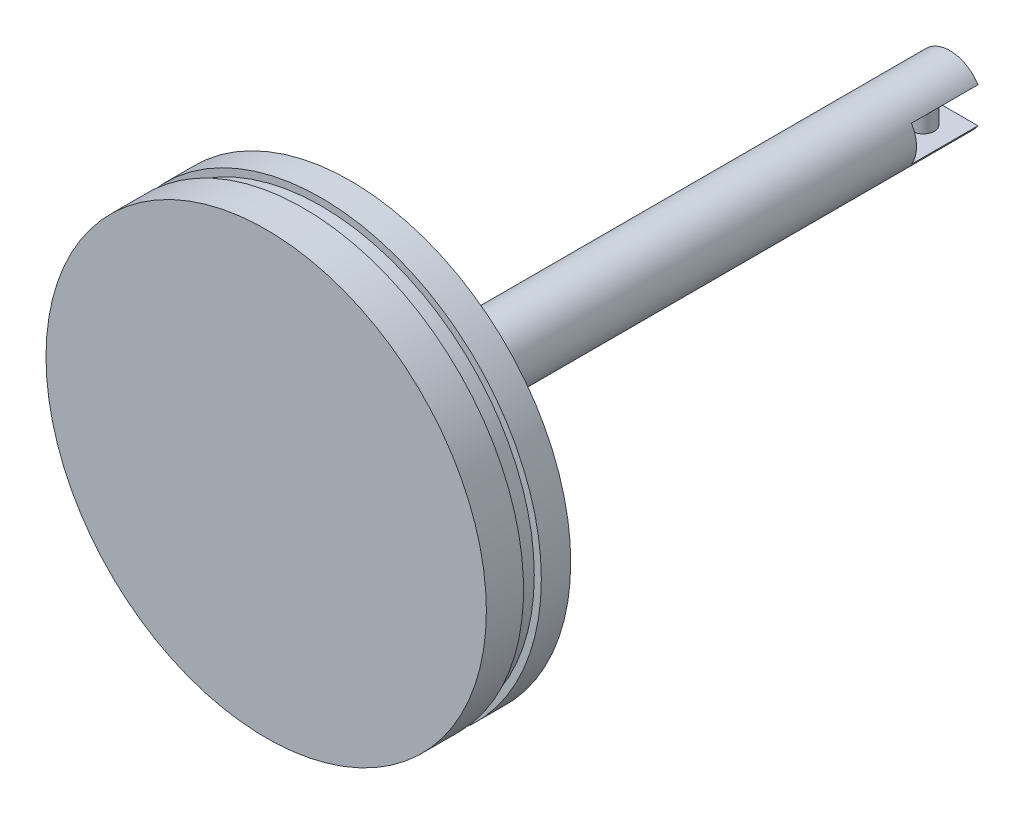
ISO-10303-21;
HEADER;
FILE_DESCRIPTION(('STEP AP214'),'2;1');
FILE_NAME('part.step','',(''),(''),'','','');
FILE_SCHEMA(('AUTOMOTIVE_DESIGN { 1 0 10303 214 1 1 1 1 }'));
ENDSEC;
DATA;
#1=APPLICATION_CONTEXT('core data for automotive mechanical design processes');
#2=APPLICATION_PROTOCOL_DEFINITION('international standard','automotive_design',2000,#1);
#3=PRODUCT_CONTEXT('',#1,'mechanical');
#4=PRODUCT('Part','Part','',(#3));
#5=PRODUCT_RELATED_PRODUCT_CATEGORY('part','',(#4));
#6=PRODUCT_DEFINITION_FORMATION('','',#4);
#7=PRODUCT_DEFINITION_CONTEXT('part definition',#1,'design');
#8=PRODUCT_DEFINITION('design','',#6,#7);
#9=PRODUCT_DEFINITION_SHAPE('','',#8);
#10=(LENGTH_UNIT() NAMED_UNIT(*) SI_UNIT(.MILLI.,.METRE.));
#11=(NAMED_UNIT(*) PLANE_ANGLE_UNIT() SI_UNIT($,.RADIAN.));
#12=(NAMED_UNIT(*) SI_UNIT($,.STERADIAN.) SOLID_ANGLE_UNIT());
#13=UNCERTAINTY_MEASURE_WITH_UNIT(LENGTH_MEASURE(1.E-05),#10,'distance_accuracy_value','');
#14=(GEOMETRIC_REPRESENTATION_CONTEXT(3) GLOBAL_UNCERTAINTY_ASSIGNED_CONTEXT((#13)) GLOBAL_UNIT_ASSIGNED_CONTEXT((#10,
#11,#12)) REPRESENTATION_CONTEXT('',''));
#15=CARTESIAN_POINT('',(0.,0.,0.));
#16=DIRECTION('',(0.,0.,1.));
#17=DIRECTION('',(1.,0.,0.));
#18=AXIS2_PLACEMENT_3D('',#15,#16,#17);
#19=CARTESIAN_POINT('',(0.,0.,-135.));
#20=DIRECTION('',(0.,0.,1.));
#21=DIRECTION('',(1.,0.,0.));
#22=AXIS2_PLACEMENT_3D('',#19,#20,#21);
#23=PLANE('',#22);
#24=CARTESIAN_POINT('',(0.,0.,-135.));
#25=DIRECTION('',(0.,0.,1.));
#26=DIRECTION('',(1.,0.,0.));
#27=AXIS2_PLACEMENT_3D('',#24,#25,#26);
#28=CIRCLE('',#27,7.5);
#29=CARTESIAN_POINT('',(-6.34428877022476,-4.,-135.));
#30=VERTEX_POINT('',#29);
#31=CARTESIAN_POINT('',(6.34428877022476,-4.,-135.));
#32=VERTEX_POINT('',#31);
#33=EDGE_CURVE('E107',#30,#32,#28,.T.);
#34=ORIENTED_EDGE('',*,*,#33,.F.);
#35=DIRECTION('',(1.,0.,0.));
#36=VECTOR('',#35,1.);
#37=CARTESIAN_POINT('',(0.,-4.,-135.));
#38=LINE('',#37,#36);
#39=EDGE_CURVE('E91',#30,#32,#38,.T.);
#40=ORIENTED_EDGE('',*,*,#39,.T.);
#41=EDGE_LOOP('',(#34,#40));
#42=FACE_BOUND('',#41,.T.);
#43=ADVANCED_FACE('F40',(#42),#23,.F.);
#44=CARTESIAN_POINT('',(0.,0.,3.));
#45=DIRECTION('',(0.,0.,-1.));
#46=DIRECTION('',(-1.,0.,0.));
#47=AXIS2_PLACEMENT_3D('',#44,#45,#46);
#48=CYLINDRICAL_SURFACE('',#47,49.6);
#49=CARTESIAN_POINT('',(0.,0.,0.));
#50=DIRECTION('',(0.,0.,1.));
#51=DIRECTION('',(1.,0.,0.));
#52=AXIS2_PLACEMENT_3D('',#49,#50,#51);
#53=CIRCLE('',#52,49.6);
#54=CARTESIAN_POINT('',(49.6,0.,0.));
#55=VERTEX_POINT('',#54);
#56=EDGE_CURVE('E155',#55,#55,#53,.T.);
#57=ORIENTED_EDGE('',*,*,#56,.T.);
#58=EDGE_LOOP('',(#57));
#59=FACE_BOUND('',#58,.T.);
#60=CARTESIAN_POINT('',(0.,0.,6.62025765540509));
#61=DIRECTION('',(0.,0.,1.));
#62=DIRECTION('',(1.,0.,0.));
#63=AXIS2_PLACEMENT_3D('',#60,#61,#62);
#64=CIRCLE('',#63,49.6);
#65=CARTESIAN_POINT('',(49.6,0.,6.62025765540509));
#66=VERTEX_POINT('',#65);
#67=EDGE_CURVE('E122',#66,#66,#64,.T.);
#68=ORIENTED_EDGE('',*,*,#67,.F.);
#69=EDGE_LOOP('',(#68));
#70=FACE_BOUND('',#69,.T.);
#71=ADVANCED_FACE('F42',(#59,#70),#48,.T.);
#72=CARTESIAN_POINT('',(0.,0.,0.));
#73=DIRECTION('',(0.,0.,1.));
#74=DIRECTION('',(1.,0.,0.));
#75=AXIS2_PLACEMENT_3D('',#72,#73,#74);
#76=PLANE('',#75);
#77=CARTESIAN_POINT('',(0.,0.,0.));
#78=DIRECTION('',(0.,0.,1.));
#79=DIRECTION('',(1.,0.,0.));
#80=AXIS2_PLACEMENT_3D('',#77,#78,#79);
#81=CIRCLE('',#80,7.5);
#82=CARTESIAN_POINT('',(7.5,0.,0.));
#83=VERTEX_POINT('',#82);
#84=EDGE_CURVE('E115',#83,#83,#81,.T.);
#85=ORIENTED_EDGE('',*,*,#84,.T.);
#86=EDGE_LOOP('',(#85));
#87=FACE_BOUND('',#86,.T.);
#88=ORIENTED_EDGE('',*,*,#56,.F.);
#89=EDGE_LOOP('',(#88));
#90=FACE_BOUND('',#89,.T.);
#91=ADVANCED_FACE('F254',(#87,#90),#76,.F.);
#92=CARTESIAN_POINT('',(0.,0.,-135.));
#93=DIRECTION('',(0.,0.,1.));
#94=DIRECTION('',(1.,0.,0.));
#95=AXIS2_PLACEMENT_3D('',#92,#93,#94);
#96=CYLINDRICAL_SURFACE('',#95,7.5);
#97=DIRECTION('',(0.,0.,1.));
#98=VECTOR('',#97,1.);
#99=CARTESIAN_POINT('',(-6.34428877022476,-4.,-135.));
#100=LINE('',#99,#98);
#101=CARTESIAN_POINT('',(-6.34428877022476,-4.,-120.));
#102=VERTEX_POINT('',#101);
#103=EDGE_CURVE('E65',#30,#102,#100,.T.);
#104=ORIENTED_EDGE('',*,*,#103,.F.);
#105=ORIENTED_EDGE('',*,*,#33,.T.);
#106=DIRECTION('',(0.,0.,1.));
#107=VECTOR('',#106,1.);
#108=CARTESIAN_POINT('',(6.34428877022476,-4.,-135.));
#109=LINE('',#108,#107);
#110=CARTESIAN_POINT('',(6.34428877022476,-4.,-120.));
#111=VERTEX_POINT('',#110);
#112=EDGE_CURVE('E216',#111,#32,#109,.F.);
#113=ORIENTED_EDGE('',*,*,#112,.F.);
#114=CARTESIAN_POINT('',(0.,0.,-120.));
#115=DIRECTION('',(0.,0.,1.));
#116=DIRECTION('',(1.,0.,0.));
#117=AXIS2_PLACEMENT_3D('',#114,#115,#116);
#118=CIRCLE('',#117,7.5);
#119=CARTESIAN_POINT('',(6.34428877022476,4.,-120.));
#120=VERTEX_POINT('',#119);
#121=EDGE_CURVE('E100',#120,#111,#118,.F.);
#122=ORIENTED_EDGE('',*,*,#121,.F.);
#123=DIRECTION('',(0.,0.,1.));
#124=VECTOR('',#123,1.);
#125=CARTESIAN_POINT('',(6.34428877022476,4.,-135.));
#126=LINE('',#125,#124);
#127=CARTESIAN_POINT('',(6.34428877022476,4.,-135.));
#128=VERTEX_POINT('',#127);
#129=EDGE_CURVE('E85',#128,#120,#126,.T.);
#130=ORIENTED_EDGE('',*,*,#129,.F.);
#131=CARTESIAN_POINT('',(-6.34428877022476,4.,-135.));
#132=VERTEX_POINT('',#131);
#133=EDGE_CURVE('E98',#128,#132,#28,.T.);
#134=ORIENTED_EDGE('',*,*,#133,.T.);
#135=DIRECTION('',(0.,0.,1.));
#136=VECTOR('',#135,1.);
#137=CARTESIAN_POINT('',(-6.34428877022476,4.,-135.));
#138=LINE('',#137,#136);
#139=CARTESIAN_POINT('',(-6.34428877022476,4.,-120.));
#140=VERTEX_POINT('',#139);
#141=EDGE_CURVE('E57',#140,#132,#138,.F.);
#142=ORIENTED_EDGE('',*,*,#141,.F.);
#143=EDGE_CURVE('E201',#102,#140,#118,.F.);
#144=ORIENTED_EDGE('',*,*,#143,.F.);
#145=EDGE_LOOP('',(#104,#105,#113,#122,#130,#134,#142,#144));
#146=FACE_BOUND('',#145,.T.);
#147=ORIENTED_EDGE('',*,*,#84,.F.);
#148=EDGE_LOOP('',(#147));
#149=FACE_BOUND('',#148,.T.);
#150=ADVANCED_FACE('F96',(#146,#149),#96,.T.);
#151=ORIENTED_EDGE('',*,*,#133,.F.);
#152=DIRECTION('',(-1.,0.,0.));
#153=VECTOR('',#152,1.);
#154=CARTESIAN_POINT('',(0.,4.,-135.));
#155=LINE('',#154,#153);
#156=EDGE_CURVE('E82',#128,#132,#155,.T.);
#157=ORIENTED_EDGE('',*,*,#156,.T.);
#158=EDGE_LOOP('',(#151,#157));
#159=FACE_BOUND('',#158,.T.);
#160=ADVANCED_FACE('F104',(#159),#23,.F.);
#161=CARTESIAN_POINT('',(0.,-50.8877083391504,6.62025765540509));
#162=DIRECTION('',(0.,0.,1.));
#163=DIRECTION('',(1.,0.,0.));
#164=AXIS2_PLACEMENT_3D('',#161,#162,#163);
#165=PLANE('',#164);
#166=CARTESIAN_POINT('',(0.,0.,6.62025765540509));
#167=DIRECTION('',(0.,0.,-1.));
#168=DIRECTION('',(-1.,0.,0.));
#169=AXIS2_PLACEMENT_3D('',#166,#167,#168);
#170=CIRCLE('',#169,48.0103822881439);
#171=CARTESIAN_POINT('',(-48.0103822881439,0.,6.62025765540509));
#172=VERTEX_POINT('',#171);
#173=EDGE_CURVE('E118',#172,#172,#170,.T.);
#174=ORIENTED_EDGE('',*,*,#173,.T.);
#175=EDGE_LOOP('',(#174));
#176=FACE_BOUND('',#175,.T.);
#177=ORIENTED_EDGE('',*,*,#67,.T.);
#178=EDGE_LOOP('',(#177));
#179=FACE_BOUND('',#178,.T.);
#180=ADVANCED_FACE('F230',(#176,#179),#165,.T.);
#181=CARTESIAN_POINT('',(0.,-50.8877083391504,10.6202576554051));
#182=DIRECTION('',(0.,0.,-1.));
#183=DIRECTION('',(-1.,0.,0.));
#184=AXIS2_PLACEMENT_3D('',#181,#182,#183);
#185=PLANE('',#184);
#186=CARTESIAN_POINT('',(0.,0.,10.6202576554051));
#187=DIRECTION('',(0.,0.,-1.));
#188=DIRECTION('',(-1.,0.,0.));
#189=AXIS2_PLACEMENT_3D('',#186,#187,#188);
#190=CIRCLE('',#189,48.0103822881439);
#191=CARTESIAN_POINT('',(-48.0103822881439,0.,10.6202576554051));
#192=VERTEX_POINT('',#191);
#193=EDGE_CURVE('E221',#192,#192,#190,.T.);
#194=ORIENTED_EDGE('',*,*,#193,.F.);
#195=EDGE_LOOP('',(#194));
#196=FACE_BOUND('',#195,.T.);
#197=CARTESIAN_POINT('',(0.,0.,10.6202576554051));
#198=DIRECTION('',(0.,0.,-1.));
#199=DIRECTION('',(-1.,0.,0.));
#200=AXIS2_PLACEMENT_3D('',#197,#198,#199);
#201=CIRCLE('',#200,49.6);
#202=CARTESIAN_POINT('',(-49.6,0.,10.6202576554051));
#203=VERTEX_POINT('',#202);
#204=EDGE_CURVE('E190',#203,#203,#201,.T.);
#205=ORIENTED_EDGE('',*,*,#204,.T.);
#206=EDGE_LOOP('',(#205));
#207=FACE_BOUND('',#206,.T.);
#208=ADVANCED_FACE('F236',(#196,#207),#185,.T.);
#209=CARTESIAN_POINT('',(0.,0.,0.));
#210=DIRECTION('',(0.,0.,-1.));
#211=DIRECTION('',(-1.,0.,0.));
#212=AXIS2_PLACEMENT_3D('',#209,#210,#211);
#213=CYLINDRICAL_SURFACE('',#212,48.0103822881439);
#214=ORIENTED_EDGE('',*,*,#193,.T.);
#215=EDGE_LOOP('',(#214));
#216=FACE_BOUND('',#215,.T.);
#217=ORIENTED_EDGE('',*,*,#173,.F.);
#218=EDGE_LOOP('',(#217));
#219=FACE_BOUND('',#218,.T.);
#220=ADVANCED_FACE('F233',(#216,#219),#213,.T.);
#221=CARTESIAN_POINT('',(0.,0.,19.));
#222=DIRECTION('',(0.,0.,1.));
#223=DIRECTION('',(1.,0.,0.));
#224=AXIS2_PLACEMENT_3D('',#221,#222,#223);
#225=PLANE('',#224);
#226=CARTESIAN_POINT('',(0.,0.,19.));
#227=DIRECTION('',(0.,0.,1.));
#228=DIRECTION('',(1.,0.,0.));
#229=AXIS2_PLACEMENT_3D('',#226,#227,#228);
#230=CIRCLE('',#229,49.6);
#231=CARTESIAN_POINT('',(49.6,0.,19.));
#232=VERTEX_POINT('',#231);
#233=EDGE_CURVE('E147',#232,#232,#230,.T.);
#234=ORIENTED_EDGE('',*,*,#233,.T.);
#235=EDGE_LOOP('',(#234));
#236=FACE_BOUND('',#235,.T.);
#237=ADVANCED_FACE('F235',(#236),#225,.T.);
#238=ORIENTED_EDGE('',*,*,#233,.F.);
#239=EDGE_LOOP('',(#238));
#240=FACE_BOUND('',#239,.T.);
#241=ORIENTED_EDGE('',*,*,#204,.F.);
#242=EDGE_LOOP('',(#241));
#243=FACE_BOUND('',#242,.T.);
#244=ADVANCED_FACE('F242',(#240,#243),#48,.T.);
#245=CARTESIAN_POINT('',(-10.6083117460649,-4.,-120.));
#246=DIRECTION('',(0.,-1.,0.));
#247=DIRECTION('',(1.,0.,0.));
#248=AXIS2_PLACEMENT_3D('',#245,#246,#247);
#249=PLANE('',#248);
#250=CARTESIAN_POINT('',(0.,-4.,-129.));
#251=DIRECTION('',(0.,-1.,0.));
#252=DIRECTION('',(1.,0.,0.));
#253=AXIS2_PLACEMENT_3D('',#250,#251,#252);
#254=CIRCLE('',#253,2.5);
#255=CARTESIAN_POINT('',(2.5,-4.,-129.));
#256=VERTEX_POINT('',#255);
#257=EDGE_CURVE('E11',#256,#256,#254,.F.);
#258=ORIENTED_EDGE('',*,*,#257,.F.);
#259=EDGE_LOOP('',(#258));
#260=FACE_BOUND('',#259,.T.);
#261=ORIENTED_EDGE('',*,*,#112,.T.);
#262=ORIENTED_EDGE('',*,*,#39,.F.);
#263=ORIENTED_EDGE('',*,*,#103,.T.);
#264=DIRECTION('',(-1.,0.,0.));
#265=VECTOR('',#264,1.);
#266=CARTESIAN_POINT('',(-10.6083117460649,-4.,-120.));
#267=LINE('',#266,#265);
#268=EDGE_CURVE('E102',#111,#102,#267,.T.);
#269=ORIENTED_EDGE('',*,*,#268,.F.);
#270=EDGE_LOOP('',(#261,#262,#263,#269));
#271=FACE_BOUND('',#270,.T.);
#272=ADVANCED_FACE('F429',(#260,#271),#249,.F.);
#273=CARTESIAN_POINT('',(-10.6083117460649,4.,-120.));
#274=DIRECTION('',(0.,1.,0.));
#275=DIRECTION('',(-1.,0.,0.));
#276=AXIS2_PLACEMENT_3D('',#273,#274,#275);
#277=PLANE('',#276);
#278=CARTESIAN_POINT('',(0.,4.,-129.));
#279=DIRECTION('',(0.,1.,0.));
#280=DIRECTION('',(-1.,0.,0.));
#281=AXIS2_PLACEMENT_3D('',#278,#279,#280);
#282=CIRCLE('',#281,2.5);
#283=CARTESIAN_POINT('',(-2.5,4.,-129.));
#284=VERTEX_POINT('',#283);
#285=EDGE_CURVE('E50',#284,#284,#282,.F.);
#286=ORIENTED_EDGE('',*,*,#285,.F.);
#287=EDGE_LOOP('',(#286));
#288=FACE_BOUND('',#287,.T.);
#289=ORIENTED_EDGE('',*,*,#141,.T.);
#290=ORIENTED_EDGE('',*,*,#156,.F.);
#291=ORIENTED_EDGE('',*,*,#129,.T.);
#292=DIRECTION('',(1.,0.,0.));
#293=VECTOR('',#292,1.);
#294=CARTESIAN_POINT('',(-10.6083117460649,4.,-120.));
#295=LINE('',#294,#293);
#296=EDGE_CURVE('E210',#140,#120,#295,.T.);
#297=ORIENTED_EDGE('',*,*,#296,.F.);
#298=EDGE_LOOP('',(#289,#290,#291,#297));
#299=FACE_BOUND('',#298,.T.);
#300=ADVANCED_FACE('F84',(#288,#299),#277,.F.);
#301=CARTESIAN_POINT('',(0.,0.,-120.));
#302=DIRECTION('',(0.,0.,1.));
#303=DIRECTION('',(1.,0.,0.));
#304=AXIS2_PLACEMENT_3D('',#301,#302,#303);
#305=PLANE('',#304);
#306=ORIENTED_EDGE('',*,*,#143,.T.);
#307=ORIENTED_EDGE('',*,*,#296,.T.);
#308=ORIENTED_EDGE('',*,*,#121,.T.);
#309=ORIENTED_EDGE('',*,*,#268,.T.);
#310=EDGE_LOOP('',(#306,#307,#308,#309));
#311=FACE_BOUND('',#310,.T.);
#312=ADVANCED_FACE('F209',(#311),#305,.F.);
#313=CARTESIAN_POINT('',(0.,6.,-129.));
#314=DIRECTION('',(0.,-1.,0.));
#315=DIRECTION('',(1.,0.,0.));
#316=AXIS2_PLACEMENT_3D('',#313,#314,#315);
#317=CYLINDRICAL_SURFACE('',#316,2.5);
#318=ORIENTED_EDGE('',*,*,#257,.T.);
#319=EDGE_LOOP('',(#318));
#320=FACE_BOUND('',#319,.T.);
#321=ORIENTED_EDGE('',*,*,#285,.T.);
#322=EDGE_LOOP('',(#321));
#323=FACE_BOUND('',#322,.T.);
#324=ADVANCED_FACE('F353',(#320,#323),#317,.T.);
#325=CLOSED_SHELL('',(#43,#71,#91,#150,#160,#180,#208,#220,#237,#244,#272,#300,#312,#324));
#326=CARTESIAN_POINT('',(0.,0.,3.));
#327=DIRECTION('',(0.,0.,1.));
#328=DIRECTION('',(1.,0.,0.));
#329=AXIS2_PLACEMENT_3D('',#326,#327,#328);
#330=PLANE('',#329);
#331=CARTESIAN_POINT('',(0.,0.,3.));
#332=DIRECTION('',(0.,0.,1.));
#333=DIRECTION('',(1.,0.,0.));
#334=AXIS2_PLACEMENT_3D('',#331,#332,#333);
#335=CIRCLE('',#334,5.);
#336=CARTESIAN_POINT('',(5.,0.,3.));
#337=VERTEX_POINT('',#336);
#338=EDGE_CURVE('E106',#337,#337,#335,.T.);
#339=ORIENTED_EDGE('',*,*,#338,.F.);
#340=EDGE_LOOP('',(#339));
#341=FACE_BOUND('',#340,.T.);
#342=CARTESIAN_POINT('',(-12.5553753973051,26.3329781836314,3.));
#343=DIRECTION('',(0.,0.,1.));
#344=DIRECTION('',(1.,0.,0.));
#345=AXIS2_PLACEMENT_3D('',#342,#343,#344);
#346=CIRCLE('',#345,2.5);
#347=CARTESIAN_POINT('',(-10.0553753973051,26.3329781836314,3.));
#348=VERTEX_POINT('',#347);
#349=EDGE_CURVE('E112',#348,#348,#346,.T.);
#350=ORIENTED_EDGE('',*,*,#349,.F.);
#351=EDGE_LOOP('',(#350));
#352=FACE_BOUND('',#351,.T.);
#353=CARTESIAN_POINT('',(17.4025494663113,21.919229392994,3.));
#354=DIRECTION('',(0.,0.,1.));
#355=DIRECTION('',(1.,0.,0.));
#356=AXIS2_PLACEMENT_3D('',#353,#354,#355);
#357=CIRCLE('',#356,2.5);
#358=CARTESIAN_POINT('',(19.9025494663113,21.919229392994,3.));
#359=VERTEX_POINT('',#358);
#360=EDGE_CURVE('E127',#359,#359,#357,.T.);
#361=ORIENTED_EDGE('',*,*,#360,.F.);
#362=EDGE_LOOP('',(#361));
#363=FACE_BOUND('',#362,.T.);
#364=CARTESIAN_POINT('',(29.0283101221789,-5.22974658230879,3.));
#365=DIRECTION('',(0.,0.,1.));
#366=DIRECTION('',(1.,0.,0.));
#367=AXIS2_PLACEMENT_3D('',#364,#365,#366);
#368=CIRCLE('',#367,2.5);
#369=CARTESIAN_POINT('',(31.5283101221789,-5.22974658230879,3.));
#370=VERTEX_POINT('',#369);
#371=EDGE_CURVE('E131',#370,#370,#368,.T.);
#372=ORIENTED_EDGE('',*,*,#371,.F.);
#373=EDGE_LOOP('',(#372));
#374=FACE_BOUND('',#373,.T.);
#375=CARTESIAN_POINT('',(10.7973914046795,-30.7469047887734,3.));
#376=DIRECTION('',(0.,0.,1.));
#377=DIRECTION('',(1.,0.,0.));
#378=AXIS2_PLACEMENT_3D('',#375,#376,#377);
#379=CIRCLE('',#378,2.5);
#380=CARTESIAN_POINT('',(13.2973914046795,-30.7469047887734,3.));
#381=VERTEX_POINT('',#380);
#382=EDGE_CURVE('E135',#381,#381,#379,.T.);
#383=ORIENTED_EDGE('',*,*,#382,.F.);
#384=EDGE_LOOP('',(#383));
#385=FACE_BOUND('',#384,.T.);
#386=CARTESIAN_POINT('',(-20.9711520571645,-26.3717704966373,3.));
#387=DIRECTION('',(0.,0.,1.));
#388=DIRECTION('',(1.,0.,0.));
#389=AXIS2_PLACEMENT_3D('',#386,#387,#388);
#390=CIRCLE('',#389,2.5);
#391=CARTESIAN_POINT('',(-18.4711520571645,-26.3717704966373,3.));
#392=VERTEX_POINT('',#391);
#393=EDGE_CURVE('E139',#392,#392,#390,.T.);
#394=ORIENTED_EDGE('',*,*,#393,.F.);
#395=EDGE_LOOP('',(#394));
#396=FACE_BOUND('',#395,.T.);
#397=CARTESIAN_POINT('',(-35.9876396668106,-3.67966705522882,3.));
#398=DIRECTION('',(0.,0.,1.));
#399=DIRECTION('',(1.,0.,0.));
#400=AXIS2_PLACEMENT_3D('',#397,#398,#399);
#401=CIRCLE('',#400,2.5);
#402=CARTESIAN_POINT('',(-33.4876396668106,-3.67966705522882,3.));
#403=VERTEX_POINT('',#402);
#404=EDGE_CURVE('E143',#403,#403,#401,.T.);
#405=ORIENTED_EDGE('',*,*,#404,.F.);
#406=EDGE_LOOP('',(#405));
#407=FACE_BOUND('',#406,.T.);
#408=CARTESIAN_POINT('',(0.,0.,3.));
#409=DIRECTION('',(0.,0.,1.));
#410=DIRECTION('',(1.,0.,0.));
#411=AXIS2_PLACEMENT_3D('',#408,#409,#410);
#412=CIRCLE('',#411,46.);
#413=CARTESIAN_POINT('',(46.,0.,3.));
#414=VERTEX_POINT('',#413);
#415=EDGE_CURVE('E156',#414,#414,#412,.F.);
#416=ORIENTED_EDGE('',*,*,#415,.F.);
#417=EDGE_LOOP('',(#416));
#418=FACE_BOUND('',#417,.T.);
#419=ADVANCED_FACE('F304',(#341,#352,#363,#374,#385,#396,#407,#418),#330,.T.);
#420=CARTESIAN_POINT('',(0.,0.,15.));
#421=DIRECTION('',(0.,0.,-1.));
#422=DIRECTION('',(-1.,0.,0.));
#423=AXIS2_PLACEMENT_3D('',#420,#421,#422);
#424=CYLINDRICAL_SURFACE('',#423,46.);
#425=ORIENTED_EDGE('',*,*,#415,.T.);
#426=EDGE_LOOP('',(#425));
#427=FACE_BOUND('',#426,.T.);
#428=CARTESIAN_POINT('',(0.,0.,15.));
#429=DIRECTION('',(0.,0.,1.));
#430=DIRECTION('',(1.,0.,0.));
#431=AXIS2_PLACEMENT_3D('',#428,#429,#430);
#432=CIRCLE('',#431,46.);
#433=CARTESIAN_POINT('',(46.,0.,15.));
#434=VERTEX_POINT('',#433);
#435=EDGE_CURVE('E151',#434,#434,#432,.T.);
#436=ORIENTED_EDGE('',*,*,#435,.T.);
#437=EDGE_LOOP('',(#436));
#438=FACE_BOUND('',#437,.T.);
#439=ADVANCED_FACE('F300',(#427,#438),#424,.F.);
#440=CARTESIAN_POINT('',(0.,0.,15.));
#441=DIRECTION('',(0.,0.,1.));
#442=DIRECTION('',(1.,0.,0.));
#443=AXIS2_PLACEMENT_3D('',#440,#441,#442);
#444=PLANE('',#443);
#445=CARTESIAN_POINT('',(0.,0.,15.));
#446=DIRECTION('',(0.,0.,1.));
#447=DIRECTION('',(1.,0.,0.));
#448=AXIS2_PLACEMENT_3D('',#445,#446,#447);
#449=CIRCLE('',#448,5.);
#450=CARTESIAN_POINT('',(5.,0.,15.));
#451=VERTEX_POINT('',#450);
#452=EDGE_CURVE('E92',#451,#451,#449,.F.);
#453=ORIENTED_EDGE('',*,*,#452,.F.);
#454=EDGE_LOOP('',(#453));
#455=FACE_BOUND('',#454,.T.);
#456=CARTESIAN_POINT('',(-12.5553753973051,26.3329781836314,15.));
#457=DIRECTION('',(0.,0.,1.));
#458=DIRECTION('',(1.,0.,0.));
#459=AXIS2_PLACEMENT_3D('',#456,#457,#458);
#460=CIRCLE('',#459,2.5);
#461=CARTESIAN_POINT('',(-10.0553753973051,26.3329781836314,15.));
#462=VERTEX_POINT('',#461);
#463=EDGE_CURVE('E183',#462,#462,#460,.F.);
#464=ORIENTED_EDGE('',*,*,#463,.F.);
#465=EDGE_LOOP('',(#464));
#466=FACE_BOUND('',#465,.T.);
#467=CARTESIAN_POINT('',(17.4025494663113,21.919229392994,15.));
#468=DIRECTION('',(0.,0.,1.));
#469=DIRECTION('',(1.,0.,0.));
#470=AXIS2_PLACEMENT_3D('',#467,#468,#469);
#471=CIRCLE('',#470,2.5);
#472=CARTESIAN_POINT('',(19.9025494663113,21.919229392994,15.));
#473=VERTEX_POINT('',#472);
#474=EDGE_CURVE('E179',#473,#473,#471,.F.);
#475=ORIENTED_EDGE('',*,*,#474,.F.);
#476=EDGE_LOOP('',(#475));
#477=FACE_BOUND('',#476,.T.);
#478=CARTESIAN_POINT('',(29.0283101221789,-5.22974658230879,15.));
#479=DIRECTION('',(0.,0.,1.));
#480=DIRECTION('',(1.,0.,0.));
#481=AXIS2_PLACEMENT_3D('',#478,#479,#480);
#482=CIRCLE('',#481,2.5);
#483=CARTESIAN_POINT('',(31.5283101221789,-5.22974658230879,15.));
#484=VERTEX_POINT('',#483);
#485=EDGE_CURVE('E175',#484,#484,#482,.F.);
#486=ORIENTED_EDGE('',*,*,#485,.F.);
#487=EDGE_LOOP('',(#486));
#488=FACE_BOUND('',#487,.T.);
#489=CARTESIAN_POINT('',(10.7973914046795,-30.7469047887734,15.));
#490=DIRECTION('',(0.,0.,1.));
#491=DIRECTION('',(1.,0.,0.));
#492=AXIS2_PLACEMENT_3D('',#489,#490,#491);
#493=CIRCLE('',#492,2.5);
#494=CARTESIAN_POINT('',(13.2973914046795,-30.7469047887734,15.));
#495=VERTEX_POINT('',#494);
#496=EDGE_CURVE('E171',#495,#495,#493,.F.);
#497=ORIENTED_EDGE('',*,*,#496,.F.);
#498=EDGE_LOOP('',(#497));
#499=FACE_BOUND('',#498,.T.);
#500=CARTESIAN_POINT('',(-20.9711520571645,-26.3717704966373,15.));
#501=DIRECTION('',(0.,0.,1.));
#502=DIRECTION('',(1.,0.,0.));
#503=AXIS2_PLACEMENT_3D('',#500,#501,#502);
#504=CIRCLE('',#503,2.5);
#505=CARTESIAN_POINT('',(-18.4711520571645,-26.3717704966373,15.));
#506=VERTEX_POINT('',#505);
#507=EDGE_CURVE('E167',#506,#506,#504,.F.);
#508=ORIENTED_EDGE('',*,*,#507,.F.);
#509=EDGE_LOOP('',(#508));
#510=FACE_BOUND('',#509,.T.);
#511=CARTESIAN_POINT('',(-35.9876396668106,-3.67966705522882,15.));
#512=DIRECTION('',(0.,0.,1.));
#513=DIRECTION('',(1.,0.,0.));
#514=AXIS2_PLACEMENT_3D('',#511,#512,#513);
#515=CIRCLE('',#514,2.5);
#516=CARTESIAN_POINT('',(-33.4876396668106,-3.67966705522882,15.));
#517=VERTEX_POINT('',#516);
#518=EDGE_CURVE('E160',#517,#517,#515,.F.);
#519=ORIENTED_EDGE('',*,*,#518,.F.);
#520=EDGE_LOOP('',(#519));
#521=FACE_BOUND('',#520,.T.);
#522=ORIENTED_EDGE('',*,*,#435,.F.);
#523=EDGE_LOOP('',(#522));
#524=FACE_BOUND('',#523,.T.);
#525=ADVANCED_FACE('F295',(#455,#466,#477,#488,#499,#510,#521,#524),#444,.F.);
#526=CARTESIAN_POINT('',(-35.9876396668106,-3.67966705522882,19.));
#527=DIRECTION('',(0.,0.,-1.));
#528=DIRECTION('',(-1.,0.,0.));
#529=AXIS2_PLACEMENT_3D('',#526,#527,#528);
#530=CYLINDRICAL_SURFACE('',#529,2.5);
#531=ORIENTED_EDGE('',*,*,#404,.T.);
#532=EDGE_LOOP('',(#531));
#533=FACE_BOUND('',#532,.T.);
#534=ORIENTED_EDGE('',*,*,#518,.T.);
#535=EDGE_LOOP('',(#534));
#536=FACE_BOUND('',#535,.T.);
#537=ADVANCED_FACE('F292',(#533,#536),#530,.T.);
#538=CARTESIAN_POINT('',(-20.9711520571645,-26.3717704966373,19.));
#539=DIRECTION('',(0.,0.,-1.));
#540=DIRECTION('',(-1.,0.,0.));
#541=AXIS2_PLACEMENT_3D('',#538,#539,#540);
#542=CYLINDRICAL_SURFACE('',#541,2.5);
#543=ORIENTED_EDGE('',*,*,#393,.T.);
#544=EDGE_LOOP('',(#543));
#545=FACE_BOUND('',#544,.T.);
#546=ORIENTED_EDGE('',*,*,#507,.T.);
#547=EDGE_LOOP('',(#546));
#548=FACE_BOUND('',#547,.T.);
#549=ADVANCED_FACE('F288',(#545,#548),#542,.T.);
#550=CARTESIAN_POINT('',(10.7973914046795,-30.7469047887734,19.));
#551=DIRECTION('',(0.,0.,-1.));
#552=DIRECTION('',(-1.,0.,0.));
#553=AXIS2_PLACEMENT_3D('',#550,#551,#552);
#554=CYLINDRICAL_SURFACE('',#553,2.5);
#555=ORIENTED_EDGE('',*,*,#382,.T.);
#556=EDGE_LOOP('',(#555));
#557=FACE_BOUND('',#556,.T.);
#558=ORIENTED_EDGE('',*,*,#496,.T.);
#559=EDGE_LOOP('',(#558));
#560=FACE_BOUND('',#559,.T.);
#561=ADVANCED_FACE('F284',(#557,#560),#554,.T.);
#562=CARTESIAN_POINT('',(29.0283101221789,-5.22974658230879,19.));
#563=DIRECTION('',(0.,0.,-1.));
#564=DIRECTION('',(-1.,0.,0.));
#565=AXIS2_PLACEMENT_3D('',#562,#563,#564);
#566=CYLINDRICAL_SURFACE('',#565,2.5);
#567=ORIENTED_EDGE('',*,*,#371,.T.);
#568=EDGE_LOOP('',(#567));
#569=FACE_BOUND('',#568,.T.);
#570=ORIENTED_EDGE('',*,*,#485,.T.);
#571=EDGE_LOOP('',(#570));
#572=FACE_BOUND('',#571,.T.);
#573=ADVANCED_FACE('F280',(#569,#572),#566,.T.);
#574=CARTESIAN_POINT('',(17.4025494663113,21.919229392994,19.));
#575=DIRECTION('',(0.,0.,-1.));
#576=DIRECTION('',(-1.,0.,0.));
#577=AXIS2_PLACEMENT_3D('',#574,#575,#576);
#578=CYLINDRICAL_SURFACE('',#577,2.5);
#579=ORIENTED_EDGE('',*,*,#360,.T.);
#580=EDGE_LOOP('',(#579));
#581=FACE_BOUND('',#580,.T.);
#582=ORIENTED_EDGE('',*,*,#474,.T.);
#583=EDGE_LOOP('',(#582));
#584=FACE_BOUND('',#583,.T.);
#585=ADVANCED_FACE('F276',(#581,#584),#578,.T.);
#586=CARTESIAN_POINT('',(-12.5553753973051,26.3329781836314,19.));
#587=DIRECTION('',(0.,0.,-1.));
#588=DIRECTION('',(-1.,0.,0.));
#589=AXIS2_PLACEMENT_3D('',#586,#587,#588);
#590=CYLINDRICAL_SURFACE('',#589,2.5);
#591=ORIENTED_EDGE('',*,*,#349,.T.);
#592=EDGE_LOOP('',(#591));
#593=FACE_BOUND('',#592,.T.);
#594=ORIENTED_EDGE('',*,*,#463,.T.);
#595=EDGE_LOOP('',(#594));
#596=FACE_BOUND('',#595,.T.);
#597=ADVANCED_FACE('F271',(#593,#596),#590,.T.);
#598=CARTESIAN_POINT('',(0.,0.,19.));
#599=DIRECTION('',(0.,0.,-1.));
#600=DIRECTION('',(-1.,0.,0.));
#601=AXIS2_PLACEMENT_3D('',#598,#599,#600);
#602=CYLINDRICAL_SURFACE('',#601,5.);
#603=ORIENTED_EDGE('',*,*,#338,.T.);
#604=EDGE_LOOP('',(#603));
#605=FACE_BOUND('',#604,.T.);
#606=ORIENTED_EDGE('',*,*,#452,.T.);
#607=EDGE_LOOP('',(#606));
#608=FACE_BOUND('',#607,.T.);
#609=ADVANCED_FACE('F268',(#605,#608),#602,.T.);
#610=CLOSED_SHELL('',(#419,#439,#525,#537,#549,#561,#573,#585,#597,#609));
#611=ORIENTED_CLOSED_SHELL('',*,#610,.T.);
#612=BREP_WITH_VOIDS('B2',#325,(#611));
#613=ADVANCED_BREP_SHAPE_REPRESENTATION('',(#18,#612),#14);
#614=SHAPE_DEFINITION_REPRESENTATION(#9,#613);
ENDSEC;
END-ISO-10303-21;
